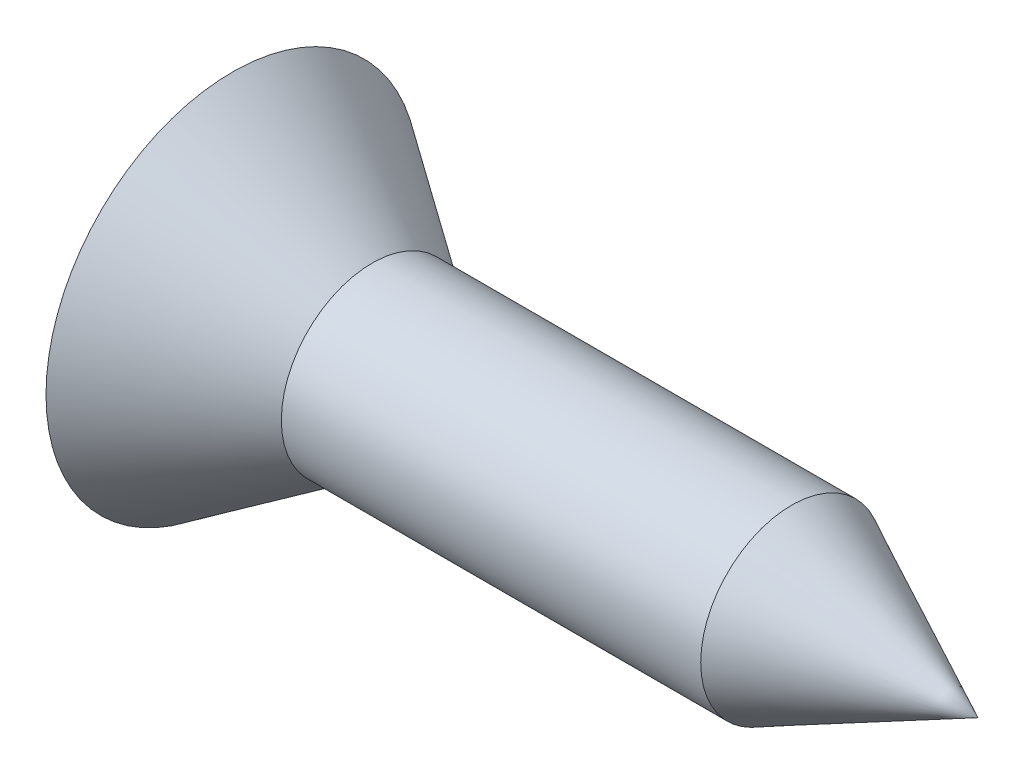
from build123d import *


with BuildPart() as part:
    # Esquisse1 → Base-R_volution (revolve)
    with BuildSketch(Plane.XY, mode=Mode.PRIVATE) as base_r_volution_sk:
        Polygon((0, 0), (0, 4), (3, 1.95), (12, 1.95), (16, 0), align=None)
    revolve(base_r_volution_sk.sketch.rotate(Axis((-40, 0, 0), (1, 0, 0)), 90), axis=Axis((-40, 0, 0), (1, 0, 0)))


solid = part.part
